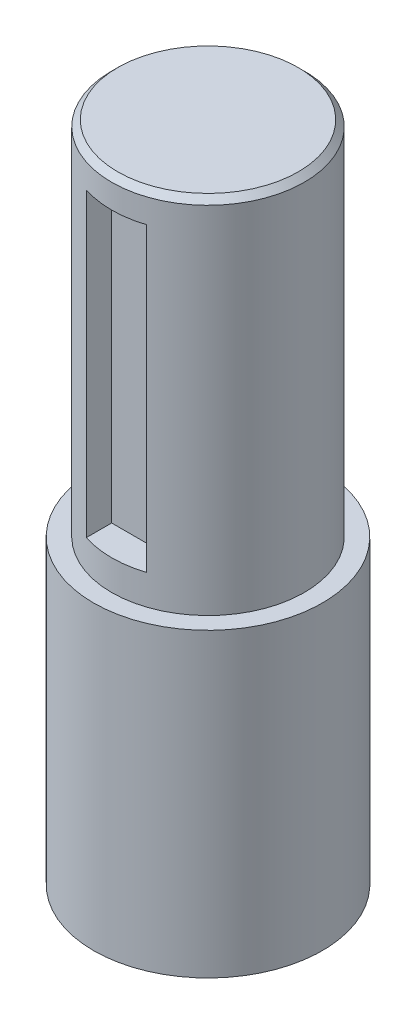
ISO-10303-21;
HEADER;
FILE_DESCRIPTION(('STEP AP214'),'2;1');
FILE_NAME('part.step','',(''),(''),'','','');
FILE_SCHEMA(('AUTOMOTIVE_DESIGN { 1 0 10303 214 1 1 1 1 }'));
ENDSEC;
DATA;
#1=APPLICATION_CONTEXT('core data for automotive mechanical design processes');
#2=APPLICATION_PROTOCOL_DEFINITION('international standard','automotive_design',2000,#1);
#3=PRODUCT_CONTEXT('',#1,'mechanical');
#4=PRODUCT('Part','Part','',(#3));
#5=PRODUCT_RELATED_PRODUCT_CATEGORY('part','',(#4));
#6=PRODUCT_DEFINITION_FORMATION('','',#4);
#7=PRODUCT_DEFINITION_CONTEXT('part definition',#1,'design');
#8=PRODUCT_DEFINITION('design','',#6,#7);
#9=PRODUCT_DEFINITION_SHAPE('','',#8);
#10=(LENGTH_UNIT() NAMED_UNIT(*) SI_UNIT(.MILLI.,.METRE.));
#11=(NAMED_UNIT(*) PLANE_ANGLE_UNIT() SI_UNIT($,.RADIAN.));
#12=(NAMED_UNIT(*) SI_UNIT($,.STERADIAN.) SOLID_ANGLE_UNIT());
#13=UNCERTAINTY_MEASURE_WITH_UNIT(LENGTH_MEASURE(1.E-05),#10,'distance_accuracy_value','');
#14=(GEOMETRIC_REPRESENTATION_CONTEXT(3) GLOBAL_UNCERTAINTY_ASSIGNED_CONTEXT((#13)) GLOBAL_UNIT_ASSIGNED_CONTEXT((#10,
#11,#12)) REPRESENTATION_CONTEXT('',''));
#15=CARTESIAN_POINT('',(0.,0.,0.));
#16=DIRECTION('',(0.,0.,1.));
#17=DIRECTION('',(1.,0.,0.));
#18=AXIS2_PLACEMENT_3D('',#15,#16,#17);
#19=CARTESIAN_POINT('',(0.,60.,0.));
#20=DIRECTION('',(0.,-1.,0.));
#21=DIRECTION('',(0.,0.,-1.));
#22=AXIS2_PLACEMENT_3D('',#19,#20,#21);
#23=CYLINDRICAL_SURFACE('',#22,16.);
#24=CARTESIAN_POINT('',(0.,59.,0.));
#25=DIRECTION('',(0.,1.,0.));
#26=DIRECTION('',(0.,0.,1.));
#27=AXIS2_PLACEMENT_3D('',#24,#25,#26);
#28=CIRCLE('',#27,16.);
#29=CARTESIAN_POINT('',(0.,59.,16.));
#30=VERTEX_POINT('',#29);
#31=EDGE_CURVE('E11',#30,#30,#28,.F.);
#32=ORIENTED_EDGE('',*,*,#31,.T.);
#33=EDGE_LOOP('',(#32));
#34=FACE_BOUND('',#33,.T.);
#35=CARTESIAN_POINT('',(0.,55.,0.));
#36=DIRECTION('',(0.,1.,0.));
#37=DIRECTION('',(0.,0.,1.));
#38=AXIS2_PLACEMENT_3D('',#35,#36,#37);
#39=CIRCLE('',#38,16.);
#40=CARTESIAN_POINT('',(-5.,55.,15.1986841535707));
#41=VERTEX_POINT('',#40);
#42=CARTESIAN_POINT('',(5.,55.,15.1986841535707));
#43=VERTEX_POINT('',#42);
#44=EDGE_CURVE('E132',#41,#43,#39,.T.);
#45=ORIENTED_EDGE('',*,*,#44,.T.);
#46=DIRECTION('',(0.,-1.,0.));
#47=VECTOR('',#46,1.);
#48=CARTESIAN_POINT('',(5.,60.,15.1986841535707));
#49=LINE('',#48,#47);
#50=CARTESIAN_POINT('',(5.,5.,15.1986841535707));
#51=VERTEX_POINT('',#50);
#52=EDGE_CURVE('E97',#43,#51,#49,.T.);
#53=ORIENTED_EDGE('',*,*,#52,.T.);
#54=CARTESIAN_POINT('',(0.,5.,0.));
#55=DIRECTION('',(0.,-1.,0.));
#56=DIRECTION('',(0.,0.,-1.));
#57=AXIS2_PLACEMENT_3D('',#54,#55,#56);
#58=CIRCLE('',#57,16.);
#59=CARTESIAN_POINT('',(-5.,5.,15.1986841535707));
#60=VERTEX_POINT('',#59);
#61=EDGE_CURVE('E62',#51,#60,#58,.T.);
#62=ORIENTED_EDGE('',*,*,#61,.T.);
#63=DIRECTION('',(0.,-1.,0.));
#64=VECTOR('',#63,1.);
#65=CARTESIAN_POINT('',(-5.,60.,15.1986841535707));
#66=LINE('',#65,#64);
#67=EDGE_CURVE('E70',#60,#41,#66,.F.);
#68=ORIENTED_EDGE('',*,*,#67,.T.);
#69=EDGE_LOOP('',(#45,#53,#62,#68));
#70=FACE_BOUND('',#69,.T.);
#71=CARTESIAN_POINT('',(0.,0.,0.));
#72=DIRECTION('',(0.,1.,0.));
#73=DIRECTION('',(0.,0.,1.));
#74=AXIS2_PLACEMENT_3D('',#71,#72,#73);
#75=CIRCLE('',#74,16.);
#76=CARTESIAN_POINT('',(0.,0.,16.));
#77=VERTEX_POINT('',#76);
#78=EDGE_CURVE('E115',#77,#77,#75,.T.);
#79=ORIENTED_EDGE('',*,*,#78,.T.);
#80=EDGE_LOOP('',(#79));
#81=FACE_BOUND('',#80,.T.);
#82=ADVANCED_FACE('F45',(#34,#70,#81),#23,.T.);
#83=CARTESIAN_POINT('',(0.,60.,0.));
#84=DIRECTION('',(0.,1.,0.));
#85=DIRECTION('',(0.,0.,1.));
#86=AXIS2_PLACEMENT_3D('',#83,#84,#85);
#87=PLANE('',#86);
#88=CARTESIAN_POINT('',(0.,60.,0.));
#89=DIRECTION('',(0.,1.,0.));
#90=DIRECTION('',(0.,0.,1.));
#91=AXIS2_PLACEMENT_3D('',#88,#89,#90);
#92=CIRCLE('',#91,15.);
#93=CARTESIAN_POINT('',(0.,60.,15.));
#94=VERTEX_POINT('',#93);
#95=EDGE_CURVE('E55',#94,#94,#92,.T.);
#96=ORIENTED_EDGE('',*,*,#95,.T.);
#97=EDGE_LOOP('',(#96));
#98=FACE_BOUND('',#97,.T.);
#99=ADVANCED_FACE('F149',(#98),#87,.T.);
#100=CARTESIAN_POINT('',(5.,55.,11.));
#101=DIRECTION('',(1.,0.,0.));
#102=DIRECTION('',(0.,1.,0.));
#103=AXIS2_PLACEMENT_3D('',#100,#101,#102);
#104=PLANE('',#103);
#105=DIRECTION('',(0.,0.,1.));
#106=VECTOR('',#105,1.);
#107=CARTESIAN_POINT('',(5.,55.,11.));
#108=LINE('',#107,#106);
#109=CARTESIAN_POINT('',(5.,55.,11.));
#110=VERTEX_POINT('',#109);
#111=EDGE_CURVE('E90',#110,#43,#108,.T.);
#112=ORIENTED_EDGE('',*,*,#111,.F.);
#113=DIRECTION('',(0.,1.,0.));
#114=VECTOR('',#113,1.);
#115=CARTESIAN_POINT('',(5.,55.,11.));
#116=LINE('',#115,#114);
#117=CARTESIAN_POINT('',(5.,5.,11.));
#118=VERTEX_POINT('',#117);
#119=EDGE_CURVE('E94',#118,#110,#116,.T.);
#120=ORIENTED_EDGE('',*,*,#119,.F.);
#121=DIRECTION('',(0.,0.,1.));
#122=VECTOR('',#121,1.);
#123=CARTESIAN_POINT('',(5.,5.,11.));
#124=LINE('',#123,#122);
#125=EDGE_CURVE('E129',#118,#51,#124,.T.);
#126=ORIENTED_EDGE('',*,*,#125,.T.);
#127=ORIENTED_EDGE('',*,*,#52,.F.);
#128=EDGE_LOOP('',(#112,#120,#126,#127));
#129=FACE_BOUND('',#128,.T.);
#130=ADVANCED_FACE('F92',(#129),#104,.F.);
#131=CARTESIAN_POINT('',(-5.,5.,11.));
#132=DIRECTION('',(0.,-1.,0.));
#133=DIRECTION('',(0.,0.,-1.));
#134=AXIS2_PLACEMENT_3D('',#131,#132,#133);
#135=PLANE('',#134);
#136=ORIENTED_EDGE('',*,*,#125,.F.);
#137=DIRECTION('',(1.,0.,0.));
#138=VECTOR('',#137,1.);
#139=CARTESIAN_POINT('',(-5.,5.,11.));
#140=LINE('',#139,#138);
#141=CARTESIAN_POINT('',(-5.,5.,11.));
#142=VERTEX_POINT('',#141);
#143=EDGE_CURVE('E101',#142,#118,#140,.T.);
#144=ORIENTED_EDGE('',*,*,#143,.F.);
#145=DIRECTION('',(0.,0.,1.));
#146=VECTOR('',#145,1.);
#147=CARTESIAN_POINT('',(-5.,5.,11.));
#148=LINE('',#147,#146);
#149=EDGE_CURVE('E133',#142,#60,#148,.T.);
#150=ORIENTED_EDGE('',*,*,#149,.T.);
#151=ORIENTED_EDGE('',*,*,#61,.F.);
#152=EDGE_LOOP('',(#136,#144,#150,#151));
#153=FACE_BOUND('',#152,.T.);
#154=ADVANCED_FACE('F172',(#153),#135,.F.);
#155=CARTESIAN_POINT('',(-5.,55.,11.));
#156=DIRECTION('',(-1.,0.,0.));
#157=DIRECTION('',(0.,-1.,0.));
#158=AXIS2_PLACEMENT_3D('',#155,#156,#157);
#159=PLANE('',#158);
#160=ORIENTED_EDGE('',*,*,#149,.F.);
#161=DIRECTION('',(0.,-1.,0.));
#162=VECTOR('',#161,1.);
#163=CARTESIAN_POINT('',(-5.,55.,11.));
#164=LINE('',#163,#162);
#165=CARTESIAN_POINT('',(-5.,55.,11.));
#166=VERTEX_POINT('',#165);
#167=EDGE_CURVE('E110',#166,#142,#164,.T.);
#168=ORIENTED_EDGE('',*,*,#167,.F.);
#169=DIRECTION('',(0.,0.,1.));
#170=VECTOR('',#169,1.);
#171=CARTESIAN_POINT('',(-5.,55.,11.));
#172=LINE('',#171,#170);
#173=EDGE_CURVE('E100',#166,#41,#172,.T.);
#174=ORIENTED_EDGE('',*,*,#173,.T.);
#175=ORIENTED_EDGE('',*,*,#67,.F.);
#176=EDGE_LOOP('',(#160,#168,#174,#175));
#177=FACE_BOUND('',#176,.T.);
#178=ADVANCED_FACE('F175',(#177),#159,.F.);
#179=CARTESIAN_POINT('',(-5.,55.,11.));
#180=DIRECTION('',(0.,1.,0.));
#181=DIRECTION('',(0.,0.,1.));
#182=AXIS2_PLACEMENT_3D('',#179,#180,#181);
#183=PLANE('',#182);
#184=ORIENTED_EDGE('',*,*,#44,.F.);
#185=ORIENTED_EDGE('',*,*,#173,.F.);
#186=DIRECTION('',(-1.,0.,0.));
#187=VECTOR('',#186,1.);
#188=CARTESIAN_POINT('',(-5.,55.,11.));
#189=LINE('',#188,#187);
#190=EDGE_CURVE('E104',#110,#166,#189,.T.);
#191=ORIENTED_EDGE('',*,*,#190,.F.);
#192=ORIENTED_EDGE('',*,*,#111,.T.);
#193=EDGE_LOOP('',(#184,#185,#191,#192));
#194=FACE_BOUND('',#193,.T.);
#195=ADVANCED_FACE('F105',(#194),#183,.F.);
#196=CARTESIAN_POINT('',(0.,0.,11.));
#197=DIRECTION('',(0.,0.,1.));
#198=DIRECTION('',(1.,0.,0.));
#199=AXIS2_PLACEMENT_3D('',#196,#197,#198);
#200=PLANE('',#199);
#201=ORIENTED_EDGE('',*,*,#119,.T.);
#202=ORIENTED_EDGE('',*,*,#190,.T.);
#203=ORIENTED_EDGE('',*,*,#167,.T.);
#204=ORIENTED_EDGE('',*,*,#143,.T.);
#205=EDGE_LOOP('',(#201,#202,#203,#204));
#206=FACE_BOUND('',#205,.T.);
#207=ADVANCED_FACE('F112',(#206),#200,.T.);
#208=CARTESIAN_POINT('',(0.,-50.,0.));
#209=DIRECTION('',(0.,1.,0.));
#210=DIRECTION('',(0.,0.,1.));
#211=AXIS2_PLACEMENT_3D('',#208,#209,#210);
#212=CYLINDRICAL_SURFACE('',#211,19.);
#213=CARTESIAN_POINT('',(0.,-50.,0.));
#214=DIRECTION('',(0.,-1.,0.));
#215=DIRECTION('',(0.,0.,-1.));
#216=AXIS2_PLACEMENT_3D('',#213,#214,#215);
#217=CIRCLE('',#216,19.);
#218=CARTESIAN_POINT('',(0.,-50.,-19.));
#219=VERTEX_POINT('',#218);
#220=EDGE_CURVE('E119',#219,#219,#217,.T.);
#221=ORIENTED_EDGE('',*,*,#220,.F.);
#222=EDGE_LOOP('',(#221));
#223=FACE_BOUND('',#222,.T.);
#224=CARTESIAN_POINT('',(0.,0.,0.));
#225=DIRECTION('',(0.,-1.,0.));
#226=DIRECTION('',(0.,0.,-1.));
#227=AXIS2_PLACEMENT_3D('',#224,#225,#226);
#228=CIRCLE('',#227,19.);
#229=CARTESIAN_POINT('',(0.,0.,-19.));
#230=VERTEX_POINT('',#229);
#231=EDGE_CURVE('E122',#230,#230,#228,.T.);
#232=ORIENTED_EDGE('',*,*,#231,.T.);
#233=EDGE_LOOP('',(#232));
#234=FACE_BOUND('',#233,.T.);
#235=ADVANCED_FACE('F182',(#223,#234),#212,.T.);
#236=CARTESIAN_POINT('',(0.,-50.,0.));
#237=DIRECTION('',(0.,-1.,0.));
#238=DIRECTION('',(0.,0.,-1.));
#239=AXIS2_PLACEMENT_3D('',#236,#237,#238);
#240=PLANE('',#239);
#241=ORIENTED_EDGE('',*,*,#220,.T.);
#242=EDGE_LOOP('',(#241));
#243=FACE_BOUND('',#242,.T.);
#244=ADVANCED_FACE('F157',(#243),#240,.T.);
#245=CARTESIAN_POINT('',(0.,0.,0.));
#246=DIRECTION('',(0.,-1.,0.));
#247=DIRECTION('',(0.,0.,-1.));
#248=AXIS2_PLACEMENT_3D('',#245,#246,#247);
#249=PLANE('',#248);
#250=ORIENTED_EDGE('',*,*,#78,.F.);
#251=EDGE_LOOP('',(#250));
#252=FACE_BOUND('',#251,.T.);
#253=ORIENTED_EDGE('',*,*,#231,.F.);
#254=EDGE_LOOP('',(#253));
#255=FACE_BOUND('',#254,.T.);
#256=ADVANCED_FACE('F152',(#252,#255),#249,.F.);
#257=CARTESIAN_POINT('',(0.,60.,0.));
#258=DIRECTION('',(0.,-1.,0.));
#259=DIRECTION('',(0.,0.,-1.));
#260=AXIS2_PLACEMENT_3D('',#257,#258,#259);
#261=CONICAL_SURFACE('',#260,15.,0.785398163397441);
#262=ORIENTED_EDGE('',*,*,#31,.F.);
#263=EDGE_LOOP('',(#262));
#264=FACE_BOUND('',#263,.T.);
#265=ORIENTED_EDGE('',*,*,#95,.F.);
#266=EDGE_LOOP('',(#265));
#267=FACE_BOUND('',#266,.T.);
#268=ADVANCED_FACE('F48',(#264,#267),#261,.T.);
#269=CLOSED_SHELL('',(#82,#99,#130,#154,#178,#195,#207,#235,#244,#256,#268));
#270=MANIFOLD_SOLID_BREP('B2',#269);
#271=ADVANCED_BREP_SHAPE_REPRESENTATION('',(#18,#270),#14);
#272=SHAPE_DEFINITION_REPRESENTATION(#9,#271);
ENDSEC;
END-ISO-10303-21;
